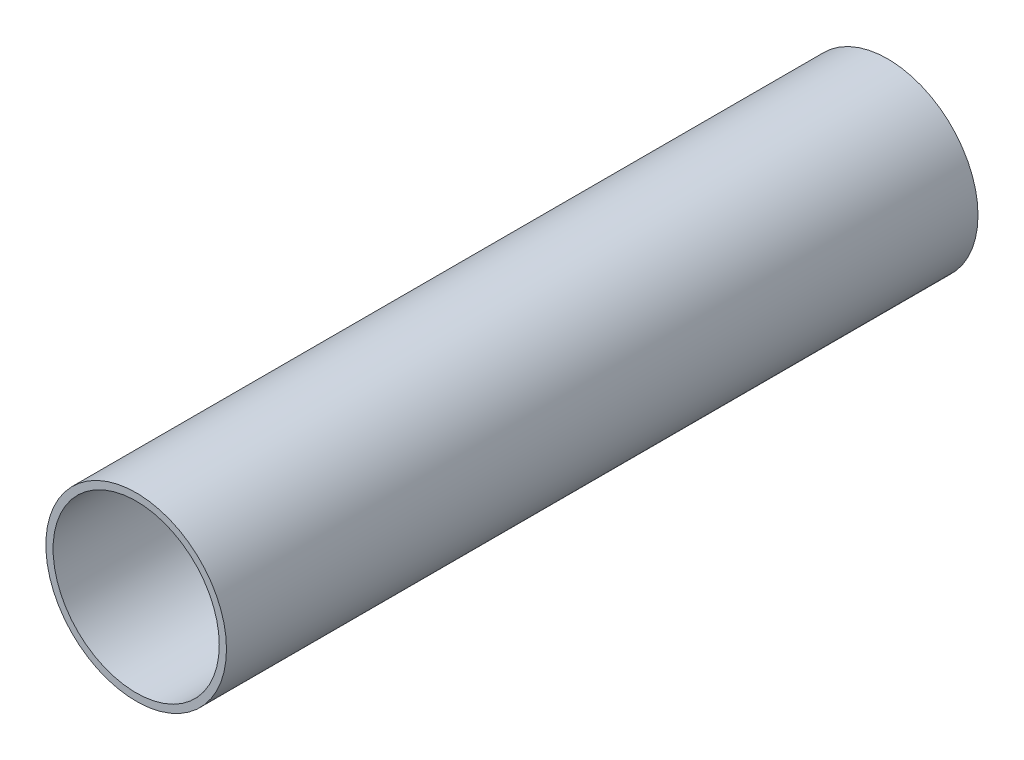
ISO-10303-21;
HEADER;
FILE_DESCRIPTION(('STEP AP214'),'2;1');
FILE_NAME('part.step','',(''),(''),'','','');
FILE_SCHEMA(('AUTOMOTIVE_DESIGN { 1 0 10303 214 1 1 1 1 }'));
ENDSEC;
DATA;
#1=APPLICATION_CONTEXT('core data for automotive mechanical design processes');
#2=APPLICATION_PROTOCOL_DEFINITION('international standard','automotive_design',2000,#1);
#3=PRODUCT_CONTEXT('',#1,'mechanical');
#4=PRODUCT('Part','Part','',(#3));
#5=PRODUCT_RELATED_PRODUCT_CATEGORY('part','',(#4));
#6=PRODUCT_DEFINITION_FORMATION('','',#4);
#7=PRODUCT_DEFINITION_CONTEXT('part definition',#1,'design');
#8=PRODUCT_DEFINITION('design','',#6,#7);
#9=PRODUCT_DEFINITION_SHAPE('','',#8);
#10=(LENGTH_UNIT() NAMED_UNIT(*) SI_UNIT(.MILLI.,.METRE.));
#11=(NAMED_UNIT(*) PLANE_ANGLE_UNIT() SI_UNIT($,.RADIAN.));
#12=(NAMED_UNIT(*) SI_UNIT($,.STERADIAN.) SOLID_ANGLE_UNIT());
#13=UNCERTAINTY_MEASURE_WITH_UNIT(LENGTH_MEASURE(1.E-05),#10,'distance_accuracy_value','');
#14=(GEOMETRIC_REPRESENTATION_CONTEXT(3) GLOBAL_UNCERTAINTY_ASSIGNED_CONTEXT((#13)) GLOBAL_UNIT_ASSIGNED_CONTEXT((#10,
#11,#12)) REPRESENTATION_CONTEXT('',''));
#15=CARTESIAN_POINT('',(0.,0.,0.));
#16=DIRECTION('',(0.,0.,1.));
#17=DIRECTION('',(1.,0.,0.));
#18=AXIS2_PLACEMENT_3D('',#15,#16,#17);
#19=CARTESIAN_POINT('',(0.,0.,-104.));
#20=DIRECTION('',(0.,0.,1.));
#21=DIRECTION('',(1.,0.,0.));
#22=AXIS2_PLACEMENT_3D('',#19,#20,#21);
#23=CYLINDRICAL_SURFACE('',#22,25.);
#24=CARTESIAN_POINT('',(0.,0.,-104.));
#25=DIRECTION('',(0.,0.,1.));
#26=DIRECTION('',(1.,0.,0.));
#27=AXIS2_PLACEMENT_3D('',#24,#25,#26);
#28=CIRCLE('',#27,25.);
#29=CARTESIAN_POINT('',(25.,0.,-104.));
#30=VERTEX_POINT('',#29);
#31=EDGE_CURVE('E10',#30,#30,#28,.T.);
#32=CARTESIAN_POINT('',(0.,0.,104.));
#33=DIRECTION('',(0.,0.,1.));
#34=DIRECTION('',(1.,0.,0.));
#35=AXIS2_PLACEMENT_3D('',#32,#33,#34);
#36=CIRCLE('',#35,25.);
#37=CARTESIAN_POINT('',(25.,0.,104.));
#38=VERTEX_POINT('',#37);
#39=EDGE_CURVE('E38',#38,#38,#36,.T.);
#40=CARTESIAN_POINT('',(25.,0.,-104.));
#41=CARTESIAN_POINT('',(25.,0.,-101.833333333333));
#42=CARTESIAN_POINT('',(25.,0.,-99.6666666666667));
#43=CARTESIAN_POINT('',(25.,0.,-95.3333333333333));
#44=CARTESIAN_POINT('',(25.,0.,-93.1666666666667));
#45=CARTESIAN_POINT('',(25.,0.,-88.8333333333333));
#46=CARTESIAN_POINT('',(25.,0.,-86.6666666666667));
#47=CARTESIAN_POINT('',(25.,0.,-82.3333333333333));
#48=CARTESIAN_POINT('',(25.,0.,-80.1666666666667));
#49=CARTESIAN_POINT('',(25.,0.,-75.8333333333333));
#50=CARTESIAN_POINT('',(25.,0.,-73.6666666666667));
#51=CARTESIAN_POINT('',(25.,0.,-69.3333333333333));
#52=CARTESIAN_POINT('',(25.,0.,-67.1666666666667));
#53=CARTESIAN_POINT('',(25.,0.,-62.8333333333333));
#54=CARTESIAN_POINT('',(25.,0.,-60.6666666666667));
#55=CARTESIAN_POINT('',(25.,0.,-56.3333333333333));
#56=CARTESIAN_POINT('',(25.,0.,-54.1666666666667));
#57=CARTESIAN_POINT('',(25.,0.,-49.8333333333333));
#58=CARTESIAN_POINT('',(25.,0.,-47.6666666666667));
#59=CARTESIAN_POINT('',(25.,0.,-43.3333333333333));
#60=CARTESIAN_POINT('',(25.,0.,-41.1666666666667));
#61=CARTESIAN_POINT('',(25.,0.,-36.8333333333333));
#62=CARTESIAN_POINT('',(25.,0.,-34.6666666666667));
#63=CARTESIAN_POINT('',(25.,0.,-30.3333333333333));
#64=CARTESIAN_POINT('',(25.,0.,-28.1666666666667));
#65=CARTESIAN_POINT('',(25.,0.,-23.8333333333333));
#66=CARTESIAN_POINT('',(25.,0.,-21.6666666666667));
#67=CARTESIAN_POINT('',(25.,0.,-17.3333333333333));
#68=CARTESIAN_POINT('',(25.,0.,-15.1666666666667));
#69=CARTESIAN_POINT('',(25.,0.,-10.8333333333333));
#70=CARTESIAN_POINT('',(25.,0.,-8.66666666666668));
#71=CARTESIAN_POINT('',(25.,0.,-4.33333333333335));
#72=CARTESIAN_POINT('',(25.,0.,-2.16666666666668));
#73=CARTESIAN_POINT('',(25.,0.,2.16666666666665));
#74=CARTESIAN_POINT('',(25.,0.,4.33333333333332));
#75=CARTESIAN_POINT('',(25.,0.,8.66666666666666));
#76=CARTESIAN_POINT('',(25.,0.,10.8333333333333));
#77=CARTESIAN_POINT('',(25.,0.,15.1666666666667));
#78=CARTESIAN_POINT('',(25.,0.,17.3333333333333));
#79=CARTESIAN_POINT('',(25.,0.,21.6666666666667));
#80=CARTESIAN_POINT('',(25.,0.,23.8333333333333));
#81=CARTESIAN_POINT('',(25.,0.,28.1666666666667));
#82=CARTESIAN_POINT('',(25.,0.,30.3333333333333));
#83=CARTESIAN_POINT('',(25.,0.,34.6666666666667));
#84=CARTESIAN_POINT('',(25.,0.,36.8333333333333));
#85=CARTESIAN_POINT('',(25.,0.,41.1666666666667));
#86=CARTESIAN_POINT('',(25.,0.,43.3333333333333));
#87=CARTESIAN_POINT('',(25.,0.,47.6666666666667));
#88=CARTESIAN_POINT('',(25.,0.,49.8333333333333));
#89=CARTESIAN_POINT('',(25.,0.,54.1666666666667));
#90=CARTESIAN_POINT('',(25.,0.,56.3333333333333));
#91=CARTESIAN_POINT('',(25.,0.,60.6666666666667));
#92=CARTESIAN_POINT('',(25.,0.,62.8333333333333));
#93=CARTESIAN_POINT('',(25.,0.,67.1666666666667));
#94=CARTESIAN_POINT('',(25.,0.,69.3333333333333));
#95=CARTESIAN_POINT('',(25.,0.,73.6666666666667));
#96=CARTESIAN_POINT('',(25.,0.,75.8333333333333));
#97=CARTESIAN_POINT('',(25.,0.,80.1666666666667));
#98=CARTESIAN_POINT('',(25.,0.,82.3333333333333));
#99=CARTESIAN_POINT('',(25.,0.,86.6666666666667));
#100=CARTESIAN_POINT('',(25.,0.,88.8333333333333));
#101=CARTESIAN_POINT('',(25.,0.,93.1666666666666));
#102=CARTESIAN_POINT('',(25.,0.,95.3333333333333));
#103=CARTESIAN_POINT('',(25.,0.,99.6666666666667));
#104=CARTESIAN_POINT('',(25.,0.,101.833333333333));
#105=CARTESIAN_POINT('',(25.,0.,104.));
#106=B_SPLINE_CURVE_WITH_KNOTS('',3,(#40,#41,#42,#43,#44,#45,#46,#47,#48,#49,#50,#51,#52,#53,
#54,#55,#56,#57,#58,#59,#60,#61,#62,#63,#64,#65,#66,#67,#68,#69,#70,#71,#72,#73,#74,#75,#76,#77,
#78,#79,#80,#81,#82,#83,#84,#85,#86,#87,#88,#89,#90,#91,#92,#93,#94,#95,#96,#97,#98,#99,#100,
#101,#102,#103,#104,#105),.UNSPECIFIED.,.F.,.F.,(4,2,2,2,2,2,2,2,2,2,2,2,2,2,2,2,2,2,2,2,2,2,2,
2,2,2,2,2,2,2,2,2,4),(0.,6.50000000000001,13.,19.5,26.,32.5,39.,45.5,52.,58.5,65.,71.5,78.,84.5,
91.,97.5,104.,110.5,117.,123.5,130.,136.5,143.,149.5,156.,162.5,169.,175.5,182.,188.5,195.,
201.5,208.),.UNSPECIFIED.);
#107=EDGE_CURVE('BSEAM28',#30,#38,#106,.T.);
#108=ORIENTED_EDGE('',*,*,#31,.T.);
#109=ORIENTED_EDGE('',*,*,#39,.F.);
#110=ORIENTED_EDGE('',*,*,#107,.T.);
#111=ORIENTED_EDGE('',*,*,#107,.F.);
#112=EDGE_LOOP('',(#108,#110,#109,#111));
#113=FACE_BOUND('',#112,.T.);
#114=ADVANCED_FACE('F28',(#113),#23,.T.);
#115=CARTESIAN_POINT('',(0.,0.,-104.));
#116=DIRECTION('',(0.,0.,1.));
#117=DIRECTION('',(1.,0.,0.));
#118=AXIS2_PLACEMENT_3D('',#115,#116,#117);
#119=PLANE('',#118);
#120=CARTESIAN_POINT('',(0.,0.,-104.));
#121=DIRECTION('',(0.,0.,1.));
#122=DIRECTION('',(1.,0.,0.));
#123=AXIS2_PLACEMENT_3D('',#120,#121,#122);
#124=CIRCLE('',#123,23.);
#125=CARTESIAN_POINT('',(23.,0.,-104.));
#126=VERTEX_POINT('',#125);
#127=EDGE_CURVE('E34',#126,#126,#124,.T.);
#128=ORIENTED_EDGE('',*,*,#127,.T.);
#129=EDGE_LOOP('',(#128));
#130=FACE_BOUND('',#129,.T.);
#131=ORIENTED_EDGE('',*,*,#31,.F.);
#132=EDGE_LOOP('',(#131));
#133=FACE_BOUND('',#132,.T.);
#134=ADVANCED_FACE('F57',(#130,#133),#119,.F.);
#135=CARTESIAN_POINT('',(0.,0.,-104.));
#136=DIRECTION('',(0.,0.,1.));
#137=DIRECTION('',(1.,0.,0.));
#138=AXIS2_PLACEMENT_3D('',#135,#136,#137);
#139=CYLINDRICAL_SURFACE('',#138,23.);
#140=CARTESIAN_POINT('',(0.,0.,104.));
#141=DIRECTION('',(0.,0.,1.));
#142=DIRECTION('',(1.,0.,0.));
#143=AXIS2_PLACEMENT_3D('',#140,#141,#142);
#144=CIRCLE('',#143,23.);
#145=CARTESIAN_POINT('',(23.,0.,104.));
#146=VERTEX_POINT('',#145);
#147=EDGE_CURVE('E42',#146,#146,#144,.T.);
#148=CARTESIAN_POINT('',(23.,0.,-104.));
#149=CARTESIAN_POINT('',(23.,0.,-101.833333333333));
#150=CARTESIAN_POINT('',(23.,0.,-99.6666666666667));
#151=CARTESIAN_POINT('',(23.,0.,-95.3333333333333));
#152=CARTESIAN_POINT('',(23.,0.,-93.1666666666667));
#153=CARTESIAN_POINT('',(23.,0.,-88.8333333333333));
#154=CARTESIAN_POINT('',(23.,0.,-86.6666666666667));
#155=CARTESIAN_POINT('',(23.,0.,-82.3333333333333));
#156=CARTESIAN_POINT('',(23.,0.,-80.1666666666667));
#157=CARTESIAN_POINT('',(23.,0.,-75.8333333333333));
#158=CARTESIAN_POINT('',(23.,0.,-73.6666666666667));
#159=CARTESIAN_POINT('',(23.,0.,-69.3333333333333));
#160=CARTESIAN_POINT('',(23.,0.,-67.1666666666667));
#161=CARTESIAN_POINT('',(23.,0.,-62.8333333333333));
#162=CARTESIAN_POINT('',(23.,0.,-60.6666666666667));
#163=CARTESIAN_POINT('',(23.,0.,-56.3333333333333));
#164=CARTESIAN_POINT('',(23.,0.,-54.1666666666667));
#165=CARTESIAN_POINT('',(23.,0.,-49.8333333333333));
#166=CARTESIAN_POINT('',(23.,0.,-47.6666666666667));
#167=CARTESIAN_POINT('',(23.,0.,-43.3333333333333));
#168=CARTESIAN_POINT('',(23.,0.,-41.1666666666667));
#169=CARTESIAN_POINT('',(23.,0.,-36.8333333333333));
#170=CARTESIAN_POINT('',(23.,0.,-34.6666666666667));
#171=CARTESIAN_POINT('',(23.,0.,-30.3333333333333));
#172=CARTESIAN_POINT('',(23.,0.,-28.1666666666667));
#173=CARTESIAN_POINT('',(23.,0.,-23.8333333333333));
#174=CARTESIAN_POINT('',(23.,0.,-21.6666666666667));
#175=CARTESIAN_POINT('',(23.,0.,-17.3333333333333));
#176=CARTESIAN_POINT('',(23.,0.,-15.1666666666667));
#177=CARTESIAN_POINT('',(23.,0.,-10.8333333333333));
#178=CARTESIAN_POINT('',(23.,0.,-8.66666666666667));
#179=CARTESIAN_POINT('',(23.,0.,-4.33333333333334));
#180=CARTESIAN_POINT('',(23.,0.,-2.16666666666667));
#181=CARTESIAN_POINT('',(23.,0.,2.16666666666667));
#182=CARTESIAN_POINT('',(23.,0.,4.33333333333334));
#183=CARTESIAN_POINT('',(23.,0.,8.66666666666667));
#184=CARTESIAN_POINT('',(23.,0.,10.8333333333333));
#185=CARTESIAN_POINT('',(23.,0.,15.1666666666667));
#186=CARTESIAN_POINT('',(23.,0.,17.3333333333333));
#187=CARTESIAN_POINT('',(23.,0.,21.6666666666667));
#188=CARTESIAN_POINT('',(23.,0.,23.8333333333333));
#189=CARTESIAN_POINT('',(23.,0.,28.1666666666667));
#190=CARTESIAN_POINT('',(23.,0.,30.3333333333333));
#191=CARTESIAN_POINT('',(23.,0.,34.6666666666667));
#192=CARTESIAN_POINT('',(23.,0.,36.8333333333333));
#193=CARTESIAN_POINT('',(23.,0.,41.1666666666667));
#194=CARTESIAN_POINT('',(23.,0.,43.3333333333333));
#195=CARTESIAN_POINT('',(23.,0.,47.6666666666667));
#196=CARTESIAN_POINT('',(23.,0.,49.8333333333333));
#197=CARTESIAN_POINT('',(23.,0.,54.1666666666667));
#198=CARTESIAN_POINT('',(23.,0.,56.3333333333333));
#199=CARTESIAN_POINT('',(23.,0.,60.6666666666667));
#200=CARTESIAN_POINT('',(23.,0.,62.8333333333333));
#201=CARTESIAN_POINT('',(23.,0.,67.1666666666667));
#202=CARTESIAN_POINT('',(23.,0.,69.3333333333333));
#203=CARTESIAN_POINT('',(23.,0.,73.6666666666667));
#204=CARTESIAN_POINT('',(23.,0.,75.8333333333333));
#205=CARTESIAN_POINT('',(23.,0.,80.1666666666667));
#206=CARTESIAN_POINT('',(23.,0.,82.3333333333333));
#207=CARTESIAN_POINT('',(23.,0.,86.6666666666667));
#208=CARTESIAN_POINT('',(23.,0.,88.8333333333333));
#209=CARTESIAN_POINT('',(23.,0.,93.1666666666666));
#210=CARTESIAN_POINT('',(23.,0.,95.3333333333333));
#211=CARTESIAN_POINT('',(23.,0.,99.6666666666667));
#212=CARTESIAN_POINT('',(23.,0.,101.833333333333));
#213=CARTESIAN_POINT('',(23.,0.,104.));
#214=B_SPLINE_CURVE_WITH_KNOTS('',3,(#148,#149,#150,#151,#152,#153,#154,#155,#156,#157,#158,
#159,#160,#161,#162,#163,#164,#165,#166,#167,#168,#169,#170,#171,#172,#173,#174,#175,#176,#177,
#178,#179,#180,#181,#182,#183,#184,#185,#186,#187,#188,#189,#190,#191,#192,#193,#194,#195,#196,
#197,#198,#199,#200,#201,#202,#203,#204,#205,#206,#207,#208,#209,#210,#211,#212,#213),
.UNSPECIFIED.,.F.,.F.,(4,2,2,2,2,2,2,2,2,2,2,2,2,2,2,2,2,2,2,2,2,2,2,2,2,2,2,2,2,2,2,2,4),(0.,
6.49999999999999,13.,19.5,26.,32.5,39.,45.5,52.,58.5,65.,71.5,78.,84.5,91.,97.5,104.,110.5,117.,
123.5,130.,136.5,143.,149.5,156.,162.5,169.,175.5,182.,188.5,195.,201.5,208.),.UNSPECIFIED.);
#215=EDGE_CURVE('BSEAM48',#126,#146,#214,.T.);
#216=ORIENTED_EDGE('',*,*,#127,.F.);
#217=ORIENTED_EDGE('',*,*,#147,.T.);
#218=ORIENTED_EDGE('',*,*,#215,.T.);
#219=ORIENTED_EDGE('',*,*,#215,.F.);
#220=EDGE_LOOP('',(#216,#218,#217,#219));
#221=FACE_BOUND('',#220,.T.);
#222=ADVANCED_FACE('F48',(#221),#139,.F.);
#223=CARTESIAN_POINT('',(0.,0.,104.));
#224=DIRECTION('',(0.,0.,1.));
#225=DIRECTION('',(1.,0.,0.));
#226=AXIS2_PLACEMENT_3D('',#223,#224,#225);
#227=PLANE('',#226);
#228=ORIENTED_EDGE('',*,*,#39,.T.);
#229=EDGE_LOOP('',(#228));
#230=FACE_BOUND('',#229,.T.);
#231=ORIENTED_EDGE('',*,*,#147,.F.);
#232=EDGE_LOOP('',(#231));
#233=FACE_BOUND('',#232,.T.);
#234=ADVANCED_FACE('F50',(#230,#233),#227,.T.);
#235=CLOSED_SHELL('',(#114,#134,#222,#234));
#236=MANIFOLD_SOLID_BREP('B2',#235);
#237=ADVANCED_BREP_SHAPE_REPRESENTATION('',(#18,#236),#14);
#238=SHAPE_DEFINITION_REPRESENTATION(#9,#237);
ENDSEC;
END-ISO-10303-21;
